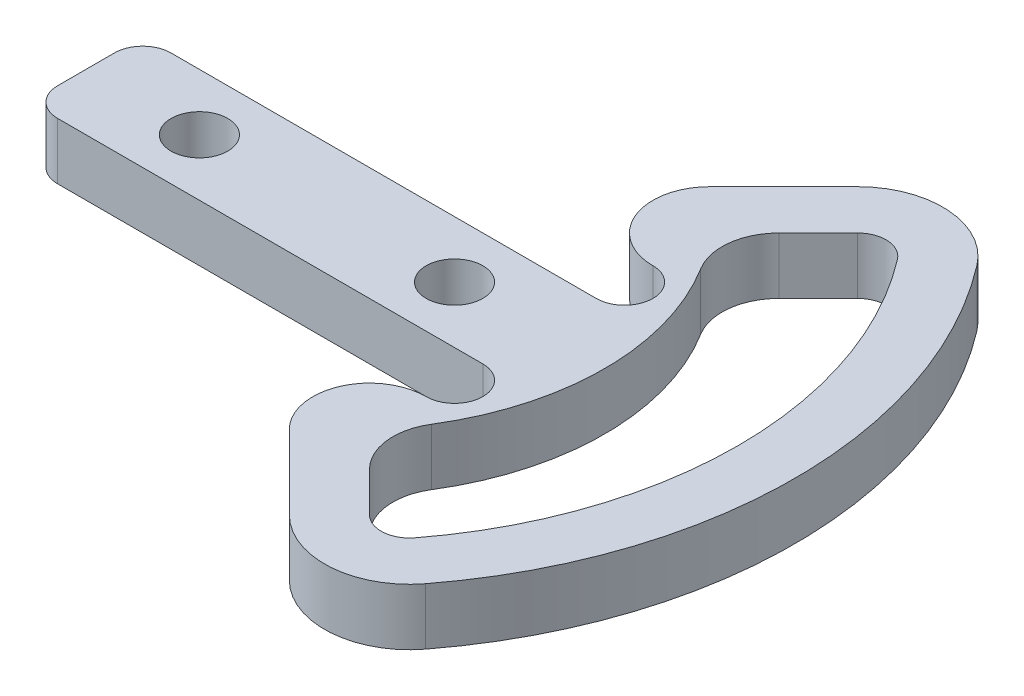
ISO-10303-21;
HEADER;
FILE_DESCRIPTION(('STEP AP214'),'2;1');
FILE_NAME('part.step','',(''),(''),'','','');
FILE_SCHEMA(('AUTOMOTIVE_DESIGN { 1 0 10303 214 1 1 1 1 }'));
ENDSEC;
DATA;
#1=APPLICATION_CONTEXT('core data for automotive mechanical design processes');
#2=APPLICATION_PROTOCOL_DEFINITION('international standard','automotive_design',2000,#1);
#3=PRODUCT_CONTEXT('',#1,'mechanical');
#4=PRODUCT('Part','Part','',(#3));
#5=PRODUCT_RELATED_PRODUCT_CATEGORY('part','',(#4));
#6=PRODUCT_DEFINITION_FORMATION('','',#4);
#7=PRODUCT_DEFINITION_CONTEXT('part definition',#1,'design');
#8=PRODUCT_DEFINITION('design','',#6,#7);
#9=PRODUCT_DEFINITION_SHAPE('','',#8);
#10=(LENGTH_UNIT() NAMED_UNIT(*) SI_UNIT(.MILLI.,.METRE.));
#11=(NAMED_UNIT(*) PLANE_ANGLE_UNIT() SI_UNIT($,.RADIAN.));
#12=(NAMED_UNIT(*) SI_UNIT($,.STERADIAN.) SOLID_ANGLE_UNIT());
#13=UNCERTAINTY_MEASURE_WITH_UNIT(LENGTH_MEASURE(1.E-05),#10,'distance_accuracy_value','');
#14=(GEOMETRIC_REPRESENTATION_CONTEXT(3) GLOBAL_UNCERTAINTY_ASSIGNED_CONTEXT((#13)) GLOBAL_UNIT_ASSIGNED_CONTEXT((#10,
#11,#12)) REPRESENTATION_CONTEXT('',''));
#15=CARTESIAN_POINT('',(0.,0.,0.));
#16=DIRECTION('',(0.,0.,1.));
#17=DIRECTION('',(1.,0.,0.));
#18=AXIS2_PLACEMENT_3D('',#15,#16,#17);
#19=CARTESIAN_POINT('',(5.,5.,-5.));
#20=DIRECTION('',(0.,-1.,0.));
#21=DIRECTION('',(0.,0.,-1.));
#22=AXIS2_PLACEMENT_3D('',#19,#20,#21);
#23=PLANE('',#22);
#24=CARTESIAN_POINT('',(20.,5.,0.));
#25=DIRECTION('',(0.,1.,0.));
#26=DIRECTION('',(0.,0.,1.));
#27=AXIS2_PLACEMENT_3D('',#24,#25,#26);
#28=CIRCLE('',#27,5.);
#29=CARTESIAN_POINT('',(20.,5.,5.));
#30=VERTEX_POINT('',#29);
#31=EDGE_CURVE('E204',#30,#30,#28,.T.);
#32=ORIENTED_EDGE('',*,*,#31,.F.);
#33=EDGE_LOOP('',(#32));
#34=FACE_BOUND('',#33,.T.);
#35=CARTESIAN_POINT('',(5.,5.,-5.));
#36=DIRECTION('',(0.,1.,0.));
#37=DIRECTION('',(0.,0.,-1.));
#38=AXIS2_PLACEMENT_3D('',#35,#36,#37);
#39=CIRCLE('',#38,5.);
#40=CARTESIAN_POINT('',(5.,5.,-10.));
#41=VERTEX_POINT('',#40);
#42=CARTESIAN_POINT('',(0.,5.,-5.));
#43=VERTEX_POINT('',#42);
#44=EDGE_CURVE('E279',#41,#43,#39,.T.);
#45=ORIENTED_EDGE('',*,*,#44,.T.);
#46=DIRECTION('',(0.,0.,1.));
#47=VECTOR('',#46,1.);
#48=CARTESIAN_POINT('',(0.,5.,5.));
#49=LINE('',#48,#47);
#50=CARTESIAN_POINT('',(0.,5.,5.));
#51=VERTEX_POINT('',#50);
#52=EDGE_CURVE('E282',#43,#51,#49,.T.);
#53=ORIENTED_EDGE('',*,*,#52,.T.);
#54=CARTESIAN_POINT('',(5.,5.,5.));
#55=DIRECTION('',(0.,1.,0.));
#56=DIRECTION('',(0.,0.,1.));
#57=AXIS2_PLACEMENT_3D('',#54,#55,#56);
#58=CIRCLE('',#57,5.);
#59=CARTESIAN_POINT('',(5.,5.,10.));
#60=VERTEX_POINT('',#59);
#61=EDGE_CURVE('E284',#51,#60,#58,.T.);
#62=ORIENTED_EDGE('',*,*,#61,.T.);
#63=DIRECTION('',(1.,0.,0.));
#64=VECTOR('',#63,1.);
#65=CARTESIAN_POINT('',(5.,5.,10.));
#66=LINE('',#65,#64);
#67=CARTESIAN_POINT('',(80.,5.,10.));
#68=VERTEX_POINT('',#67);
#69=EDGE_CURVE('E286',#60,#68,#66,.T.);
#70=ORIENTED_EDGE('',*,*,#69,.T.);
#71=CARTESIAN_POINT('',(80.,5.,15.));
#72=DIRECTION('',(0.,-1.,0.));
#73=DIRECTION('',(0.,0.,-1.));
#74=AXIS2_PLACEMENT_3D('',#71,#72,#73);
#75=CIRCLE('',#74,5.);
#76=CARTESIAN_POINT('',(80.,5.,20.));
#77=VERTEX_POINT('',#76);
#78=EDGE_CURVE('E288',#68,#77,#75,.T.);
#79=ORIENTED_EDGE('',*,*,#78,.T.);
#80=CARTESIAN_POINT('',(80.,5.,30.));
#81=DIRECTION('',(0.,1.,0.));
#82=DIRECTION('',(0.,0.,1.));
#83=AXIS2_PLACEMENT_3D('',#80,#81,#82);
#84=CIRCLE('',#83,9.99999999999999);
#85=CARTESIAN_POINT('',(72.9289321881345,5.,37.0710678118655));
#86=VERTEX_POINT('',#85);
#87=EDGE_CURVE('E290',#77,#86,#84,.T.);
#88=ORIENTED_EDGE('',*,*,#87,.T.);
#89=DIRECTION('',(0.707106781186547,0.,0.707106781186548));
#90=VECTOR('',#89,1.);
#91=CARTESIAN_POINT('',(72.9289321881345,5.,37.0710678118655));
#92=LINE('',#91,#90);
#93=CARTESIAN_POINT('',(85.9928689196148,5.,50.1350045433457));
#94=VERTEX_POINT('',#93);
#95=EDGE_CURVE('E292',#86,#94,#92,.T.);
#96=ORIENTED_EDGE('',*,*,#95,.T.);
#97=CARTESIAN_POINT('',(96.599470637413,5.,39.5284028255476));
#98=DIRECTION('',(0.,1.,0.));
#99=DIRECTION('',(0.,0.,1.));
#100=AXIS2_PLACEMENT_3D('',#97,#98,#99);
#101=CIRCLE('',#100,15.);
#102=CARTESIAN_POINT('',(108.507040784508,5.,48.6503419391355));
#103=VERTEX_POINT('',#102);
#104=EDGE_CURVE('E294',#94,#103,#101,.T.);
#105=ORIENTED_EDGE('',*,*,#104,.T.);
#106=CARTESIAN_POINT('',(45.,5.,0.));
#107=DIRECTION('',(0.,1.,0.));
#108=DIRECTION('',(0.,0.,-1.));
#109=AXIS2_PLACEMENT_3D('',#106,#107,#108);
#110=CIRCLE('',#109,80.);
#111=CARTESIAN_POINT('',(108.507040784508,5.,-48.6503419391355));
#112=VERTEX_POINT('',#111);
#113=EDGE_CURVE('E296',#103,#112,#110,.T.);
#114=ORIENTED_EDGE('',*,*,#113,.T.);
#115=CARTESIAN_POINT('',(96.599470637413,5.,-39.5284028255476));
#116=DIRECTION('',(0.,1.,0.));
#117=DIRECTION('',(0.,0.,-1.));
#118=AXIS2_PLACEMENT_3D('',#115,#116,#117);
#119=CIRCLE('',#118,15.);
#120=CARTESIAN_POINT('',(85.9928689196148,5.,-50.1350045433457));
#121=VERTEX_POINT('',#120);
#122=EDGE_CURVE('E298',#112,#121,#119,.T.);
#123=ORIENTED_EDGE('',*,*,#122,.T.);
#124=DIRECTION('',(-0.707106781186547,0.,0.707106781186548));
#125=VECTOR('',#124,1.);
#126=CARTESIAN_POINT('',(72.9289321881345,5.,-37.0710678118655));
#127=LINE('',#126,#125);
#128=CARTESIAN_POINT('',(72.9289321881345,5.,-37.0710678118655));
#129=VERTEX_POINT('',#128);
#130=EDGE_CURVE('E300',#121,#129,#127,.T.);
#131=ORIENTED_EDGE('',*,*,#130,.T.);
#132=CARTESIAN_POINT('',(80.,5.,-30.));
#133=DIRECTION('',(0.,1.,0.));
#134=DIRECTION('',(0.,0.,-1.));
#135=AXIS2_PLACEMENT_3D('',#132,#133,#134);
#136=CIRCLE('',#135,9.99999999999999);
#137=CARTESIAN_POINT('',(80.,5.,-20.));
#138=VERTEX_POINT('',#137);
#139=EDGE_CURVE('E302',#129,#138,#136,.T.);
#140=ORIENTED_EDGE('',*,*,#139,.T.);
#141=CARTESIAN_POINT('',(80.,5.,-15.));
#142=DIRECTION('',(0.,-1.,0.));
#143=DIRECTION('',(0.,0.,1.));
#144=AXIS2_PLACEMENT_3D('',#141,#142,#143);
#145=CIRCLE('',#144,5.);
#146=CARTESIAN_POINT('',(80.,5.,-10.));
#147=VERTEX_POINT('',#146);
#148=EDGE_CURVE('E304',#138,#147,#145,.T.);
#149=ORIENTED_EDGE('',*,*,#148,.T.);
#150=DIRECTION('',(-1.,0.,0.));
#151=VECTOR('',#150,1.);
#152=CARTESIAN_POINT('',(5.,5.,-10.));
#153=LINE('',#152,#151);
#154=EDGE_CURVE('E306',#147,#41,#153,.T.);
#155=ORIENTED_EDGE('',*,*,#154,.T.);
#156=EDGE_LOOP('',(#45,#53,#62,#70,#79,#88,#96,#105,#114,#123,#131,#140,#149,#155));
#157=FACE_BOUND('',#156,.T.);
#158=CARTESIAN_POINT('',(96.599470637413,5.,-39.5284028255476));
#159=DIRECTION('',(0.,1.,0.));
#160=DIRECTION('',(0.,0.,-1.));
#161=AXIS2_PLACEMENT_3D('',#158,#159,#160);
#162=CIRCLE('',#161,5.);
#163=CARTESIAN_POINT('',(100.568660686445,5.,-42.5690491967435));
#164=VERTEX_POINT('',#163);
#165=CARTESIAN_POINT('',(93.0639367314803,5.,-43.0639367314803));
#166=VERTEX_POINT('',#165);
#167=EDGE_CURVE('E196',#164,#166,#162,.T.);
#168=ORIENTED_EDGE('',*,*,#167,.F.);
#169=CARTESIAN_POINT('',(45.,5.,0.));
#170=DIRECTION('',(0.,1.,0.));
#171=DIRECTION('',(0.,0.,-1.));
#172=AXIS2_PLACEMENT_3D('',#169,#170,#171);
#173=CIRCLE('',#172,70.);
#174=CARTESIAN_POINT('',(100.568660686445,5.,42.5690491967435));
#175=VERTEX_POINT('',#174);
#176=EDGE_CURVE('E237',#175,#164,#173,.T.);
#177=ORIENTED_EDGE('',*,*,#176,.F.);
#178=CARTESIAN_POINT('',(96.599470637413,5.,39.5284028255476));
#179=DIRECTION('',(0.,1.,0.));
#180=DIRECTION('',(0.,0.,1.));
#181=AXIS2_PLACEMENT_3D('',#178,#179,#180);
#182=CIRCLE('',#181,4.99999999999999);
#183=CARTESIAN_POINT('',(93.0639367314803,5.,43.0639367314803));
#184=VERTEX_POINT('',#183);
#185=EDGE_CURVE('E235',#184,#175,#182,.T.);
#186=ORIENTED_EDGE('',*,*,#185,.F.);
#187=DIRECTION('',(0.707106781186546,0.,0.707106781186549));
#188=VECTOR('',#187,1.);
#189=CARTESIAN_POINT('',(86.1019934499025,5.,36.1019934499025));
#190=LINE('',#189,#188);
#191=CARTESIAN_POINT('',(86.1019934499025,5.,36.1019934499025));
#192=VERTEX_POINT('',#191);
#193=EDGE_CURVE('E233',#192,#184,#190,.T.);
#194=ORIENTED_EDGE('',*,*,#193,.F.);
#195=CARTESIAN_POINT('',(93.173061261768,5.,29.030925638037));
#196=DIRECTION('',(0.,1.,0.));
#197=DIRECTION('',(0.,0.,-1.));
#198=AXIS2_PLACEMENT_3D('',#195,#196,#197);
#199=CIRCLE('',#198,9.99999999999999);
#200=CARTESIAN_POINT('',(84.6795920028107,5.,23.7525755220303));
#201=VERTEX_POINT('',#200);
#202=EDGE_CURVE('E231',#201,#192,#199,.T.);
#203=ORIENTED_EDGE('',*,*,#202,.F.);
#204=CARTESIAN_POINT('',(46.4589803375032,5.,0.));
#205=DIRECTION('',(0.,-1.,0.));
#206=DIRECTION('',(0.,0.,-1.));
#207=AXIS2_PLACEMENT_3D('',#204,#205,#206);
#208=CIRCLE('',#207,45.);
#209=CARTESIAN_POINT('',(84.6795920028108,5.,-23.7525755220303));
#210=VERTEX_POINT('',#209);
#211=EDGE_CURVE('E229',#210,#201,#208,.T.);
#212=ORIENTED_EDGE('',*,*,#211,.F.);
#213=CARTESIAN_POINT('',(93.173061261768,5.,-29.030925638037));
#214=DIRECTION('',(0.,1.,0.));
#215=DIRECTION('',(0.,0.,-1.));
#216=AXIS2_PLACEMENT_3D('',#213,#214,#215);
#217=CIRCLE('',#216,9.99999999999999);
#218=CARTESIAN_POINT('',(86.1019934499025,5.,-36.1019934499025));
#219=VERTEX_POINT('',#218);
#220=EDGE_CURVE('E227',#219,#210,#217,.T.);
#221=ORIENTED_EDGE('',*,*,#220,.F.);
#222=DIRECTION('',(-0.707106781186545,0.,0.70710678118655));
#223=VECTOR('',#222,1.);
#224=CARTESIAN_POINT('',(86.1019934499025,5.,-36.1019934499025));
#225=LINE('',#224,#223);
#226=EDGE_CURVE('E225',#166,#219,#225,.T.);
#227=ORIENTED_EDGE('',*,*,#226,.F.);
#228=EDGE_LOOP('',(#168,#177,#186,#194,#203,#212,#221,#227));
#229=FACE_BOUND('',#228,.T.);
#230=CARTESIAN_POINT('',(65.,5.,0.));
#231=DIRECTION('',(0.,1.,0.));
#232=DIRECTION('',(0.,0.,1.));
#233=AXIS2_PLACEMENT_3D('',#230,#231,#232);
#234=CIRCLE('',#233,5.);
#235=CARTESIAN_POINT('',(65.,5.,5.));
#236=VERTEX_POINT('',#235);
#237=EDGE_CURVE('E641',#236,#236,#234,.T.);
#238=ORIENTED_EDGE('',*,*,#237,.F.);
#239=EDGE_LOOP('',(#238));
#240=FACE_BOUND('',#239,.T.);
#241=ADVANCED_FACE('F32',(#34,#157,#229,#240),#23,.F.);
#242=CARTESIAN_POINT('',(5.,-5.,-5.));
#243=DIRECTION('',(0.,-1.,0.));
#244=DIRECTION('',(0.,0.,-1.));
#245=AXIS2_PLACEMENT_3D('',#242,#243,#244);
#246=PLANE('',#245);
#247=CARTESIAN_POINT('',(20.,-5.,0.));
#248=DIRECTION('',(0.,1.,0.));
#249=DIRECTION('',(0.,0.,1.));
#250=AXIS2_PLACEMENT_3D('',#247,#248,#249);
#251=CIRCLE('',#250,5.);
#252=CARTESIAN_POINT('',(20.,-5.,5.));
#253=VERTEX_POINT('',#252);
#254=EDGE_CURVE('E207',#253,#253,#251,.T.);
#255=ORIENTED_EDGE('',*,*,#254,.T.);
#256=EDGE_LOOP('',(#255));
#257=FACE_BOUND('',#256,.T.);
#258=CARTESIAN_POINT('',(5.,-5.,-5.));
#259=DIRECTION('',(0.,1.,0.));
#260=DIRECTION('',(0.,0.,-1.));
#261=AXIS2_PLACEMENT_3D('',#258,#259,#260);
#262=CIRCLE('',#261,5.);
#263=CARTESIAN_POINT('',(5.,-5.,-10.));
#264=VERTEX_POINT('',#263);
#265=CARTESIAN_POINT('',(0.,-5.,-5.));
#266=VERTEX_POINT('',#265);
#267=EDGE_CURVE('E197',#264,#266,#262,.T.);
#268=ORIENTED_EDGE('',*,*,#267,.F.);
#269=DIRECTION('',(-1.,0.,0.));
#270=VECTOR('',#269,1.);
#271=CARTESIAN_POINT('',(5.,-5.,-10.));
#272=LINE('',#271,#270);
#273=CARTESIAN_POINT('',(80.,-5.,-10.));
#274=VERTEX_POINT('',#273);
#275=EDGE_CURVE('E277',#274,#264,#272,.T.);
#276=ORIENTED_EDGE('',*,*,#275,.F.);
#277=CARTESIAN_POINT('',(80.,-5.,-15.));
#278=DIRECTION('',(0.,-1.,0.));
#279=DIRECTION('',(0.,0.,1.));
#280=AXIS2_PLACEMENT_3D('',#277,#278,#279);
#281=CIRCLE('',#280,5.);
#282=CARTESIAN_POINT('',(80.,-5.,-20.));
#283=VERTEX_POINT('',#282);
#284=EDGE_CURVE('E275',#283,#274,#281,.T.);
#285=ORIENTED_EDGE('',*,*,#284,.F.);
#286=CARTESIAN_POINT('',(80.,-5.,-30.));
#287=DIRECTION('',(0.,1.,0.));
#288=DIRECTION('',(0.,0.,-1.));
#289=AXIS2_PLACEMENT_3D('',#286,#287,#288);
#290=CIRCLE('',#289,9.99999999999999);
#291=CARTESIAN_POINT('',(72.9289321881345,-5.,-37.0710678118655));
#292=VERTEX_POINT('',#291);
#293=EDGE_CURVE('E273',#292,#283,#290,.T.);
#294=ORIENTED_EDGE('',*,*,#293,.F.);
#295=DIRECTION('',(-0.707106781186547,0.,0.707106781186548));
#296=VECTOR('',#295,1.);
#297=CARTESIAN_POINT('',(72.9289321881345,-5.,-37.0710678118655));
#298=LINE('',#297,#296);
#299=CARTESIAN_POINT('',(85.9928689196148,-5.,-50.1350045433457));
#300=VERTEX_POINT('',#299);
#301=EDGE_CURVE('E271',#300,#292,#298,.T.);
#302=ORIENTED_EDGE('',*,*,#301,.F.);
#303=CARTESIAN_POINT('',(96.599470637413,-5.,-39.5284028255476));
#304=DIRECTION('',(0.,1.,0.));
#305=DIRECTION('',(0.,0.,-1.));
#306=AXIS2_PLACEMENT_3D('',#303,#304,#305);
#307=CIRCLE('',#306,15.);
#308=CARTESIAN_POINT('',(108.507040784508,-5.,-48.6503419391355));
#309=VERTEX_POINT('',#308);
#310=EDGE_CURVE('E269',#309,#300,#307,.T.);
#311=ORIENTED_EDGE('',*,*,#310,.F.);
#312=CARTESIAN_POINT('',(45.,-5.,0.));
#313=DIRECTION('',(0.,1.,0.));
#314=DIRECTION('',(0.,0.,-1.));
#315=AXIS2_PLACEMENT_3D('',#312,#313,#314);
#316=CIRCLE('',#315,80.);
#317=CARTESIAN_POINT('',(108.507040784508,-5.,48.6503419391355));
#318=VERTEX_POINT('',#317);
#319=EDGE_CURVE('E267',#318,#309,#316,.T.);
#320=ORIENTED_EDGE('',*,*,#319,.F.);
#321=CARTESIAN_POINT('',(96.599470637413,-5.,39.5284028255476));
#322=DIRECTION('',(0.,1.,0.));
#323=DIRECTION('',(0.,0.,1.));
#324=AXIS2_PLACEMENT_3D('',#321,#322,#323);
#325=CIRCLE('',#324,15.);
#326=CARTESIAN_POINT('',(85.9928689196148,-5.,50.1350045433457));
#327=VERTEX_POINT('',#326);
#328=EDGE_CURVE('E265',#327,#318,#325,.T.);
#329=ORIENTED_EDGE('',*,*,#328,.F.);
#330=DIRECTION('',(0.707106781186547,0.,0.707106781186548));
#331=VECTOR('',#330,1.);
#332=CARTESIAN_POINT('',(72.9289321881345,-5.,37.0710678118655));
#333=LINE('',#332,#331);
#334=CARTESIAN_POINT('',(72.9289321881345,-5.,37.0710678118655));
#335=VERTEX_POINT('',#334);
#336=EDGE_CURVE('E263',#335,#327,#333,.T.);
#337=ORIENTED_EDGE('',*,*,#336,.F.);
#338=CARTESIAN_POINT('',(80.,-5.,30.));
#339=DIRECTION('',(0.,1.,0.));
#340=DIRECTION('',(0.,0.,1.));
#341=AXIS2_PLACEMENT_3D('',#338,#339,#340);
#342=CIRCLE('',#341,9.99999999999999);
#343=CARTESIAN_POINT('',(80.,-5.,20.));
#344=VERTEX_POINT('',#343);
#345=EDGE_CURVE('E261',#344,#335,#342,.T.);
#346=ORIENTED_EDGE('',*,*,#345,.F.);
#347=CARTESIAN_POINT('',(80.,-5.,15.));
#348=DIRECTION('',(0.,-1.,0.));
#349=DIRECTION('',(0.,0.,-1.));
#350=AXIS2_PLACEMENT_3D('',#347,#348,#349);
#351=CIRCLE('',#350,5.);
#352=CARTESIAN_POINT('',(80.,-5.,10.));
#353=VERTEX_POINT('',#352);
#354=EDGE_CURVE('E259',#353,#344,#351,.T.);
#355=ORIENTED_EDGE('',*,*,#354,.F.);
#356=DIRECTION('',(1.,0.,0.));
#357=VECTOR('',#356,1.);
#358=CARTESIAN_POINT('',(5.,-5.,10.));
#359=LINE('',#358,#357);
#360=CARTESIAN_POINT('',(5.,-5.,10.));
#361=VERTEX_POINT('',#360);
#362=EDGE_CURVE('E257',#361,#353,#359,.T.);
#363=ORIENTED_EDGE('',*,*,#362,.F.);
#364=CARTESIAN_POINT('',(5.,-5.,5.));
#365=DIRECTION('',(0.,1.,0.));
#366=DIRECTION('',(0.,0.,1.));
#367=AXIS2_PLACEMENT_3D('',#364,#365,#366);
#368=CIRCLE('',#367,5.);
#369=CARTESIAN_POINT('',(0.,-5.,5.));
#370=VERTEX_POINT('',#369);
#371=EDGE_CURVE('E255',#370,#361,#368,.T.);
#372=ORIENTED_EDGE('',*,*,#371,.F.);
#373=DIRECTION('',(0.,0.,1.));
#374=VECTOR('',#373,1.);
#375=CARTESIAN_POINT('',(0.,-5.,5.));
#376=LINE('',#375,#374);
#377=EDGE_CURVE('E253',#266,#370,#376,.T.);
#378=ORIENTED_EDGE('',*,*,#377,.F.);
#379=EDGE_LOOP('',(#268,#276,#285,#294,#302,#311,#320,#329,#337,#346,#355,#363,#372,#378));
#380=FACE_BOUND('',#379,.T.);
#381=CARTESIAN_POINT('',(45.,-5.,0.));
#382=DIRECTION('',(0.,1.,0.));
#383=DIRECTION('',(0.,0.,-1.));
#384=AXIS2_PLACEMENT_3D('',#381,#382,#383);
#385=CIRCLE('',#384,70.);
#386=CARTESIAN_POINT('',(100.568660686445,-5.,42.5690491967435));
#387=VERTEX_POINT('',#386);
#388=CARTESIAN_POINT('',(100.568660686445,-5.,-42.5690491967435));
#389=VERTEX_POINT('',#388);
#390=EDGE_CURVE('E203',#387,#389,#385,.T.);
#391=ORIENTED_EDGE('',*,*,#390,.T.);
#392=CARTESIAN_POINT('',(96.599470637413,-5.,-39.5284028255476));
#393=DIRECTION('',(0.,1.,0.));
#394=DIRECTION('',(0.,0.,-1.));
#395=AXIS2_PLACEMENT_3D('',#392,#393,#394);
#396=CIRCLE('',#395,5.);
#397=CARTESIAN_POINT('',(93.0639367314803,-5.,-43.0639367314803));
#398=VERTEX_POINT('',#397);
#399=EDGE_CURVE('E55',#389,#398,#396,.T.);
#400=ORIENTED_EDGE('',*,*,#399,.T.);
#401=DIRECTION('',(-0.707106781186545,0.,0.70710678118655));
#402=VECTOR('',#401,1.);
#403=CARTESIAN_POINT('',(86.1019934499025,-5.,-36.1019934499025));
#404=LINE('',#403,#402);
#405=CARTESIAN_POINT('',(86.1019934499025,-5.,-36.1019934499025));
#406=VERTEX_POINT('',#405);
#407=EDGE_CURVE('E183',#398,#406,#404,.T.);
#408=ORIENTED_EDGE('',*,*,#407,.T.);
#409=CARTESIAN_POINT('',(93.173061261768,-5.,-29.030925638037));
#410=DIRECTION('',(0.,1.,0.));
#411=DIRECTION('',(0.,0.,-1.));
#412=AXIS2_PLACEMENT_3D('',#409,#410,#411);
#413=CIRCLE('',#412,9.99999999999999);
#414=CARTESIAN_POINT('',(84.6795920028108,-5.,-23.7525755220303));
#415=VERTEX_POINT('',#414);
#416=EDGE_CURVE('E192',#406,#415,#413,.T.);
#417=ORIENTED_EDGE('',*,*,#416,.T.);
#418=CARTESIAN_POINT('',(46.4589803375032,-5.,0.));
#419=DIRECTION('',(0.,-1.,0.));
#420=DIRECTION('',(0.,0.,-1.));
#421=AXIS2_PLACEMENT_3D('',#418,#419,#420);
#422=CIRCLE('',#421,45.);
#423=CARTESIAN_POINT('',(84.6795920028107,-5.,23.7525755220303));
#424=VERTEX_POINT('',#423);
#425=EDGE_CURVE('E212',#415,#424,#422,.T.);
#426=ORIENTED_EDGE('',*,*,#425,.T.);
#427=CARTESIAN_POINT('',(93.173061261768,-5.,29.030925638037));
#428=DIRECTION('',(0.,1.,0.));
#429=DIRECTION('',(0.,0.,-1.));
#430=AXIS2_PLACEMENT_3D('',#427,#428,#429);
#431=CIRCLE('',#430,9.99999999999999);
#432=CARTESIAN_POINT('',(86.1019934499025,-5.,36.1019934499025));
#433=VERTEX_POINT('',#432);
#434=EDGE_CURVE('E215',#424,#433,#431,.T.);
#435=ORIENTED_EDGE('',*,*,#434,.T.);
#436=DIRECTION('',(0.707106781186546,0.,0.707106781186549));
#437=VECTOR('',#436,1.);
#438=CARTESIAN_POINT('',(86.1019934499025,-5.,36.1019934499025));
#439=LINE('',#438,#437);
#440=CARTESIAN_POINT('',(93.0639367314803,-5.,43.0639367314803));
#441=VERTEX_POINT('',#440);
#442=EDGE_CURVE('E218',#433,#441,#439,.T.);
#443=ORIENTED_EDGE('',*,*,#442,.T.);
#444=CARTESIAN_POINT('',(96.599470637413,-5.,39.5284028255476));
#445=DIRECTION('',(0.,1.,0.));
#446=DIRECTION('',(0.,0.,1.));
#447=AXIS2_PLACEMENT_3D('',#444,#445,#446);
#448=CIRCLE('',#447,4.99999999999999);
#449=EDGE_CURVE('E221',#441,#387,#448,.T.);
#450=ORIENTED_EDGE('',*,*,#449,.T.);
#451=EDGE_LOOP('',(#391,#400,#408,#417,#426,#435,#443,#450));
#452=FACE_BOUND('',#451,.T.);
#453=CARTESIAN_POINT('',(65.,-5.,0.));
#454=DIRECTION('',(0.,1.,0.));
#455=DIRECTION('',(0.,0.,1.));
#456=AXIS2_PLACEMENT_3D('',#453,#454,#455);
#457=CIRCLE('',#456,5.);
#458=CARTESIAN_POINT('',(65.,-5.,5.));
#459=VERTEX_POINT('',#458);
#460=EDGE_CURVE('E644',#459,#459,#457,.T.);
#461=ORIENTED_EDGE('',*,*,#460,.T.);
#462=EDGE_LOOP('',(#461));
#463=FACE_BOUND('',#462,.T.);
#464=ADVANCED_FACE('F200',(#257,#380,#452,#463),#246,.T.);
#465=CARTESIAN_POINT('',(5.,5.,-5.));
#466=DIRECTION('',(0.,-1.,0.));
#467=DIRECTION('',(0.,0.,-1.));
#468=AXIS2_PLACEMENT_3D('',#465,#466,#467);
#469=CYLINDRICAL_SURFACE('',#468,5.);
#470=ORIENTED_EDGE('',*,*,#267,.T.);
#471=DIRECTION('',(0.,-1.,0.));
#472=VECTOR('',#471,1.);
#473=CARTESIAN_POINT('',(0.,5.,-5.));
#474=LINE('',#473,#472);
#475=EDGE_CURVE('E11',#43,#266,#474,.T.);
#476=ORIENTED_EDGE('',*,*,#475,.F.);
#477=ORIENTED_EDGE('',*,*,#44,.F.);
#478=DIRECTION('',(0.,-1.,0.));
#479=VECTOR('',#478,1.);
#480=CARTESIAN_POINT('',(5.,5.,-10.));
#481=LINE('',#480,#479);
#482=EDGE_CURVE('E308',#41,#264,#481,.T.);
#483=ORIENTED_EDGE('',*,*,#482,.T.);
#484=EDGE_LOOP('',(#470,#476,#477,#483));
#485=FACE_BOUND('',#484,.T.);
#486=ADVANCED_FACE('F34',(#485),#469,.T.);
#487=CARTESIAN_POINT('',(0.,5.,5.));
#488=DIRECTION('',(1.,0.,0.));
#489=DIRECTION('',(0.,0.,-1.));
#490=AXIS2_PLACEMENT_3D('',#487,#488,#489);
#491=PLANE('',#490);
#492=ORIENTED_EDGE('',*,*,#377,.T.);
#493=DIRECTION('',(0.,-1.,0.));
#494=VECTOR('',#493,1.);
#495=CARTESIAN_POINT('',(0.,5.,5.));
#496=LINE('',#495,#494);
#497=EDGE_CURVE('E40',#51,#370,#496,.T.);
#498=ORIENTED_EDGE('',*,*,#497,.F.);
#499=ORIENTED_EDGE('',*,*,#52,.F.);
#500=ORIENTED_EDGE('',*,*,#475,.T.);
#501=EDGE_LOOP('',(#492,#498,#499,#500));
#502=FACE_BOUND('',#501,.T.);
#503=ADVANCED_FACE('F370',(#502),#491,.F.);
#504=CARTESIAN_POINT('',(5.,5.,5.));
#505=DIRECTION('',(0.,-1.,0.));
#506=DIRECTION('',(0.,0.,-1.));
#507=AXIS2_PLACEMENT_3D('',#504,#505,#506);
#508=CYLINDRICAL_SURFACE('',#507,5.);
#509=ORIENTED_EDGE('',*,*,#371,.T.);
#510=DIRECTION('',(0.,-1.,0.));
#511=VECTOR('',#510,1.);
#512=CARTESIAN_POINT('',(5.,5.,10.));
#513=LINE('',#512,#511);
#514=EDGE_CURVE('E341',#60,#361,#513,.T.);
#515=ORIENTED_EDGE('',*,*,#514,.F.);
#516=ORIENTED_EDGE('',*,*,#61,.F.);
#517=ORIENTED_EDGE('',*,*,#497,.T.);
#518=EDGE_LOOP('',(#509,#515,#516,#517));
#519=FACE_BOUND('',#518,.T.);
#520=ADVANCED_FACE('F348',(#519),#508,.T.);
#521=CARTESIAN_POINT('',(5.,5.,10.));
#522=DIRECTION('',(0.,0.,-1.));
#523=DIRECTION('',(-1.,0.,0.));
#524=AXIS2_PLACEMENT_3D('',#521,#522,#523);
#525=PLANE('',#524);
#526=ORIENTED_EDGE('',*,*,#362,.T.);
#527=DIRECTION('',(0.,-1.,0.));
#528=VECTOR('',#527,1.);
#529=CARTESIAN_POINT('',(80.,5.,10.));
#530=LINE('',#529,#528);
#531=EDGE_CURVE('E338',#68,#353,#530,.T.);
#532=ORIENTED_EDGE('',*,*,#531,.F.);
#533=ORIENTED_EDGE('',*,*,#69,.F.);
#534=ORIENTED_EDGE('',*,*,#514,.T.);
#535=EDGE_LOOP('',(#526,#532,#533,#534));
#536=FACE_BOUND('',#535,.T.);
#537=ADVANCED_FACE('F358',(#536),#525,.F.);
#538=CARTESIAN_POINT('',(80.,5.,15.));
#539=DIRECTION('',(0.,-1.,0.));
#540=DIRECTION('',(0.,0.,-1.));
#541=AXIS2_PLACEMENT_3D('',#538,#539,#540);
#542=CYLINDRICAL_SURFACE('',#541,5.);
#543=ORIENTED_EDGE('',*,*,#354,.T.);
#544=DIRECTION('',(0.,-1.,0.));
#545=VECTOR('',#544,1.);
#546=CARTESIAN_POINT('',(80.,5.,20.));
#547=LINE('',#546,#545);
#548=EDGE_CURVE('E335',#77,#344,#547,.T.);
#549=ORIENTED_EDGE('',*,*,#548,.F.);
#550=ORIENTED_EDGE('',*,*,#78,.F.);
#551=ORIENTED_EDGE('',*,*,#531,.T.);
#552=EDGE_LOOP('',(#543,#549,#550,#551));
#553=FACE_BOUND('',#552,.T.);
#554=ADVANCED_FACE('F362',(#553),#542,.F.);
#555=CARTESIAN_POINT('',(80.,5.,30.));
#556=DIRECTION('',(0.,-1.,0.));
#557=DIRECTION('',(0.,0.,-1.));
#558=AXIS2_PLACEMENT_3D('',#555,#556,#557);
#559=CYLINDRICAL_SURFACE('',#558,9.99999999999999);
#560=ORIENTED_EDGE('',*,*,#345,.T.);
#561=DIRECTION('',(0.,-1.,0.));
#562=VECTOR('',#561,1.);
#563=CARTESIAN_POINT('',(72.9289321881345,5.,37.0710678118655));
#564=LINE('',#563,#562);
#565=EDGE_CURVE('E332',#86,#335,#564,.T.);
#566=ORIENTED_EDGE('',*,*,#565,.F.);
#567=ORIENTED_EDGE('',*,*,#87,.F.);
#568=ORIENTED_EDGE('',*,*,#548,.T.);
#569=EDGE_LOOP('',(#560,#566,#567,#568));
#570=FACE_BOUND('',#569,.T.);
#571=ADVANCED_FACE('F413',(#570),#559,.T.);
#572=CARTESIAN_POINT('',(72.9289321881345,5.,37.0710678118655));
#573=DIRECTION('',(0.707106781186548,0.,-0.707106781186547));
#574=DIRECTION('',(-0.707106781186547,0.,-0.707106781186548));
#575=AXIS2_PLACEMENT_3D('',#572,#573,#574);
#576=PLANE('',#575);
#577=ORIENTED_EDGE('',*,*,#336,.T.);
#578=DIRECTION('',(0.,-1.,0.));
#579=VECTOR('',#578,1.);
#580=CARTESIAN_POINT('',(85.9928689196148,5.,50.1350045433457));
#581=LINE('',#580,#579);
#582=EDGE_CURVE('E329',#94,#327,#581,.T.);
#583=ORIENTED_EDGE('',*,*,#582,.F.);
#584=ORIENTED_EDGE('',*,*,#95,.F.);
#585=ORIENTED_EDGE('',*,*,#565,.T.);
#586=EDGE_LOOP('',(#577,#583,#584,#585));
#587=FACE_BOUND('',#586,.T.);
#588=ADVANCED_FACE('F411',(#587),#576,.F.);
#589=CARTESIAN_POINT('',(96.599470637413,5.,39.5284028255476));
#590=DIRECTION('',(0.,-1.,0.));
#591=DIRECTION('',(0.,0.,-1.));
#592=AXIS2_PLACEMENT_3D('',#589,#590,#591);
#593=CYLINDRICAL_SURFACE('',#592,15.);
#594=ORIENTED_EDGE('',*,*,#328,.T.);
#595=DIRECTION('',(0.,-1.,0.));
#596=VECTOR('',#595,1.);
#597=CARTESIAN_POINT('',(108.507040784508,5.,48.6503419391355));
#598=LINE('',#597,#596);
#599=EDGE_CURVE('E326',#103,#318,#598,.T.);
#600=ORIENTED_EDGE('',*,*,#599,.F.);
#601=ORIENTED_EDGE('',*,*,#104,.F.);
#602=ORIENTED_EDGE('',*,*,#582,.T.);
#603=EDGE_LOOP('',(#594,#600,#601,#602));
#604=FACE_BOUND('',#603,.T.);
#605=ADVANCED_FACE('F406',(#604),#593,.T.);
#606=CARTESIAN_POINT('',(45.,5.,0.));
#607=DIRECTION('',(0.,-1.,0.));
#608=DIRECTION('',(0.,0.,-1.));
#609=AXIS2_PLACEMENT_3D('',#606,#607,#608);
#610=CYLINDRICAL_SURFACE('',#609,80.);
#611=ORIENTED_EDGE('',*,*,#319,.T.);
#612=DIRECTION('',(0.,-1.,0.));
#613=VECTOR('',#612,1.);
#614=CARTESIAN_POINT('',(108.507040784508,5.,-48.6503419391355));
#615=LINE('',#614,#613);
#616=EDGE_CURVE('E323',#112,#309,#615,.T.);
#617=ORIENTED_EDGE('',*,*,#616,.F.);
#618=ORIENTED_EDGE('',*,*,#113,.F.);
#619=ORIENTED_EDGE('',*,*,#599,.T.);
#620=EDGE_LOOP('',(#611,#617,#618,#619));
#621=FACE_BOUND('',#620,.T.);
#622=ADVANCED_FACE('F401',(#621),#610,.T.);
#623=CARTESIAN_POINT('',(96.599470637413,5.,-39.5284028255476));
#624=DIRECTION('',(0.,-1.,0.));
#625=DIRECTION('',(0.,0.,-1.));
#626=AXIS2_PLACEMENT_3D('',#623,#624,#625);
#627=CYLINDRICAL_SURFACE('',#626,15.);
#628=ORIENTED_EDGE('',*,*,#310,.T.);
#629=DIRECTION('',(0.,-1.,0.));
#630=VECTOR('',#629,1.);
#631=CARTESIAN_POINT('',(85.9928689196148,5.,-50.1350045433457));
#632=LINE('',#631,#630);
#633=EDGE_CURVE('E320',#121,#300,#632,.T.);
#634=ORIENTED_EDGE('',*,*,#633,.F.);
#635=ORIENTED_EDGE('',*,*,#122,.F.);
#636=ORIENTED_EDGE('',*,*,#616,.T.);
#637=EDGE_LOOP('',(#628,#634,#635,#636));
#638=FACE_BOUND('',#637,.T.);
#639=ADVANCED_FACE('F397',(#638),#627,.T.);
#640=CARTESIAN_POINT('',(72.9289321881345,5.,-37.0710678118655));
#641=DIRECTION('',(0.707106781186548,0.,0.707106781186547));
#642=DIRECTION('',(0.707106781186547,0.,-0.707106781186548));
#643=AXIS2_PLACEMENT_3D('',#640,#641,#642);
#644=PLANE('',#643);
#645=ORIENTED_EDGE('',*,*,#301,.T.);
#646=DIRECTION('',(0.,-1.,0.));
#647=VECTOR('',#646,1.);
#648=CARTESIAN_POINT('',(72.9289321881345,5.,-37.0710678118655));
#649=LINE('',#648,#647);
#650=EDGE_CURVE('E317',#129,#292,#649,.T.);
#651=ORIENTED_EDGE('',*,*,#650,.F.);
#652=ORIENTED_EDGE('',*,*,#130,.F.);
#653=ORIENTED_EDGE('',*,*,#633,.T.);
#654=EDGE_LOOP('',(#645,#651,#652,#653));
#655=FACE_BOUND('',#654,.T.);
#656=ADVANCED_FACE('F392',(#655),#644,.F.);
#657=CARTESIAN_POINT('',(80.,5.,-30.));
#658=DIRECTION('',(0.,-1.,0.));
#659=DIRECTION('',(0.,0.,-1.));
#660=AXIS2_PLACEMENT_3D('',#657,#658,#659);
#661=CYLINDRICAL_SURFACE('',#660,9.99999999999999);
#662=ORIENTED_EDGE('',*,*,#293,.T.);
#663=DIRECTION('',(0.,-1.,0.));
#664=VECTOR('',#663,1.);
#665=CARTESIAN_POINT('',(80.,5.,-20.));
#666=LINE('',#665,#664);
#667=EDGE_CURVE('E314',#138,#283,#666,.T.);
#668=ORIENTED_EDGE('',*,*,#667,.F.);
#669=ORIENTED_EDGE('',*,*,#139,.F.);
#670=ORIENTED_EDGE('',*,*,#650,.T.);
#671=EDGE_LOOP('',(#662,#668,#669,#670));
#672=FACE_BOUND('',#671,.T.);
#673=ADVANCED_FACE('F386',(#672),#661,.T.);
#674=CARTESIAN_POINT('',(80.,5.,-15.));
#675=DIRECTION('',(0.,-1.,0.));
#676=DIRECTION('',(0.,0.,-1.));
#677=AXIS2_PLACEMENT_3D('',#674,#675,#676);
#678=CYLINDRICAL_SURFACE('',#677,5.);
#679=ORIENTED_EDGE('',*,*,#284,.T.);
#680=DIRECTION('',(0.,-1.,0.));
#681=VECTOR('',#680,1.);
#682=CARTESIAN_POINT('',(80.,5.,-10.));
#683=LINE('',#682,#681);
#684=EDGE_CURVE('E311',#147,#274,#683,.T.);
#685=ORIENTED_EDGE('',*,*,#684,.F.);
#686=ORIENTED_EDGE('',*,*,#148,.F.);
#687=ORIENTED_EDGE('',*,*,#667,.T.);
#688=EDGE_LOOP('',(#679,#685,#686,#687));
#689=FACE_BOUND('',#688,.T.);
#690=ADVANCED_FACE('F382',(#689),#678,.F.);
#691=CARTESIAN_POINT('',(5.,5.,-10.));
#692=DIRECTION('',(0.,0.,1.));
#693=DIRECTION('',(1.,0.,0.));
#694=AXIS2_PLACEMENT_3D('',#691,#692,#693);
#695=PLANE('',#694);
#696=ORIENTED_EDGE('',*,*,#275,.T.);
#697=ORIENTED_EDGE('',*,*,#482,.F.);
#698=ORIENTED_EDGE('',*,*,#154,.F.);
#699=ORIENTED_EDGE('',*,*,#684,.T.);
#700=EDGE_LOOP('',(#696,#697,#698,#699));
#701=FACE_BOUND('',#700,.T.);
#702=ADVANCED_FACE('F377',(#701),#695,.F.);
#703=CARTESIAN_POINT('',(96.599470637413,5.,-39.5284028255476));
#704=DIRECTION('',(0.,-1.,0.));
#705=DIRECTION('',(0.,0.,-1.));
#706=AXIS2_PLACEMENT_3D('',#703,#704,#705);
#707=CYLINDRICAL_SURFACE('',#706,5.);
#708=ORIENTED_EDGE('',*,*,#399,.F.);
#709=DIRECTION('',(0.,-1.,0.));
#710=VECTOR('',#709,1.);
#711=CARTESIAN_POINT('',(100.568660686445,5.,-42.5690491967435));
#712=LINE('',#711,#710);
#713=EDGE_CURVE('E239',#164,#389,#712,.T.);
#714=ORIENTED_EDGE('',*,*,#713,.F.);
#715=ORIENTED_EDGE('',*,*,#167,.T.);
#716=DIRECTION('',(0.,-1.,0.));
#717=VECTOR('',#716,1.);
#718=CARTESIAN_POINT('',(93.0639367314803,5.,-43.0639367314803));
#719=LINE('',#718,#717);
#720=EDGE_CURVE('E185',#166,#398,#719,.T.);
#721=ORIENTED_EDGE('',*,*,#720,.T.);
#722=EDGE_LOOP('',(#708,#714,#715,#721));
#723=FACE_BOUND('',#722,.T.);
#724=ADVANCED_FACE('F194',(#723),#707,.F.);
#725=CARTESIAN_POINT('',(86.1019934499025,5.,-36.1019934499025));
#726=DIRECTION('',(0.70710678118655,0.,0.707106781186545));
#727=DIRECTION('',(0.707106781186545,0.,-0.70710678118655));
#728=AXIS2_PLACEMENT_3D('',#725,#726,#727);
#729=PLANE('',#728);
#730=ORIENTED_EDGE('',*,*,#407,.F.);
#731=ORIENTED_EDGE('',*,*,#720,.F.);
#732=ORIENTED_EDGE('',*,*,#226,.T.);
#733=DIRECTION('',(0.,-1.,0.));
#734=VECTOR('',#733,1.);
#735=CARTESIAN_POINT('',(86.1019934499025,5.,-36.1019934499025));
#736=LINE('',#735,#734);
#737=EDGE_CURVE('E188',#219,#406,#736,.T.);
#738=ORIENTED_EDGE('',*,*,#737,.T.);
#739=EDGE_LOOP('',(#730,#731,#732,#738));
#740=FACE_BOUND('',#739,.T.);
#741=ADVANCED_FACE('F184',(#740),#729,.T.);
#742=CARTESIAN_POINT('',(93.173061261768,5.,-29.030925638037));
#743=DIRECTION('',(0.,-1.,0.));
#744=DIRECTION('',(0.,0.,-1.));
#745=AXIS2_PLACEMENT_3D('',#742,#743,#744);
#746=CYLINDRICAL_SURFACE('',#745,9.99999999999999);
#747=ORIENTED_EDGE('',*,*,#416,.F.);
#748=ORIENTED_EDGE('',*,*,#737,.F.);
#749=ORIENTED_EDGE('',*,*,#220,.T.);
#750=DIRECTION('',(0.,-1.,0.));
#751=VECTOR('',#750,1.);
#752=CARTESIAN_POINT('',(84.6795920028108,5.,-23.7525755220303));
#753=LINE('',#752,#751);
#754=EDGE_CURVE('E248',#210,#415,#753,.T.);
#755=ORIENTED_EDGE('',*,*,#754,.T.);
#756=EDGE_LOOP('',(#747,#748,#749,#755));
#757=FACE_BOUND('',#756,.T.);
#758=ADVANCED_FACE('F485',(#757),#746,.F.);
#759=CARTESIAN_POINT('',(46.4589803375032,5.,0.));
#760=DIRECTION('',(0.,-1.,0.));
#761=DIRECTION('',(0.,0.,-1.));
#762=AXIS2_PLACEMENT_3D('',#759,#760,#761);
#763=CYLINDRICAL_SURFACE('',#762,45.);
#764=ORIENTED_EDGE('',*,*,#425,.F.);
#765=ORIENTED_EDGE('',*,*,#754,.F.);
#766=ORIENTED_EDGE('',*,*,#211,.T.);
#767=DIRECTION('',(0.,-1.,0.));
#768=VECTOR('',#767,1.);
#769=CARTESIAN_POINT('',(84.6795920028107,5.,23.7525755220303));
#770=LINE('',#769,#768);
#771=EDGE_CURVE('E246',#201,#424,#770,.T.);
#772=ORIENTED_EDGE('',*,*,#771,.T.);
#773=EDGE_LOOP('',(#764,#765,#766,#772));
#774=FACE_BOUND('',#773,.T.);
#775=ADVANCED_FACE('F492',(#774),#763,.T.);
#776=CARTESIAN_POINT('',(93.173061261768,5.,29.030925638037));
#777=DIRECTION('',(0.,-1.,0.));
#778=DIRECTION('',(0.,0.,-1.));
#779=AXIS2_PLACEMENT_3D('',#776,#777,#778);
#780=CYLINDRICAL_SURFACE('',#779,9.99999999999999);
#781=ORIENTED_EDGE('',*,*,#434,.F.);
#782=ORIENTED_EDGE('',*,*,#771,.F.);
#783=ORIENTED_EDGE('',*,*,#202,.T.);
#784=DIRECTION('',(0.,-1.,0.));
#785=VECTOR('',#784,1.);
#786=CARTESIAN_POINT('',(86.1019934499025,5.,36.1019934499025));
#787=LINE('',#786,#785);
#788=EDGE_CURVE('E244',#192,#433,#787,.T.);
#789=ORIENTED_EDGE('',*,*,#788,.T.);
#790=EDGE_LOOP('',(#781,#782,#783,#789));
#791=FACE_BOUND('',#790,.T.);
#792=ADVANCED_FACE('F500',(#791),#780,.F.);
#793=CARTESIAN_POINT('',(86.1019934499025,5.,36.1019934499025));
#794=DIRECTION('',(0.707106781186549,0.,-0.707106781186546));
#795=DIRECTION('',(-0.707106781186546,0.,-0.707106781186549));
#796=AXIS2_PLACEMENT_3D('',#793,#794,#795);
#797=PLANE('',#796);
#798=ORIENTED_EDGE('',*,*,#442,.F.);
#799=ORIENTED_EDGE('',*,*,#788,.F.);
#800=ORIENTED_EDGE('',*,*,#193,.T.);
#801=DIRECTION('',(0.,-1.,0.));
#802=VECTOR('',#801,1.);
#803=CARTESIAN_POINT('',(93.0639367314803,5.,43.0639367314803));
#804=LINE('',#803,#802);
#805=EDGE_CURVE('E242',#184,#441,#804,.T.);
#806=ORIENTED_EDGE('',*,*,#805,.T.);
#807=EDGE_LOOP('',(#798,#799,#800,#806));
#808=FACE_BOUND('',#807,.T.);
#809=ADVANCED_FACE('F508',(#808),#797,.T.);
#810=CARTESIAN_POINT('',(96.599470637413,5.,39.5284028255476));
#811=DIRECTION('',(0.,-1.,0.));
#812=DIRECTION('',(0.,0.,-1.));
#813=AXIS2_PLACEMENT_3D('',#810,#811,#812);
#814=CYLINDRICAL_SURFACE('',#813,4.99999999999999);
#815=ORIENTED_EDGE('',*,*,#449,.F.);
#816=ORIENTED_EDGE('',*,*,#805,.F.);
#817=ORIENTED_EDGE('',*,*,#185,.T.);
#818=DIRECTION('',(0.,-1.,0.));
#819=VECTOR('',#818,1.);
#820=CARTESIAN_POINT('',(100.568660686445,5.,42.5690491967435));
#821=LINE('',#820,#819);
#822=EDGE_CURVE('E47',#175,#387,#821,.T.);
#823=ORIENTED_EDGE('',*,*,#822,.T.);
#824=EDGE_LOOP('',(#815,#816,#817,#823));
#825=FACE_BOUND('',#824,.T.);
#826=ADVANCED_FACE('F516',(#825),#814,.F.);
#827=CARTESIAN_POINT('',(45.,5.,0.));
#828=DIRECTION('',(0.,-1.,0.));
#829=DIRECTION('',(0.,0.,-1.));
#830=AXIS2_PLACEMENT_3D('',#827,#828,#829);
#831=CYLINDRICAL_SURFACE('',#830,70.);
#832=ORIENTED_EDGE('',*,*,#390,.F.);
#833=ORIENTED_EDGE('',*,*,#822,.F.);
#834=ORIENTED_EDGE('',*,*,#176,.T.);
#835=ORIENTED_EDGE('',*,*,#713,.T.);
#836=EDGE_LOOP('',(#832,#833,#834,#835));
#837=FACE_BOUND('',#836,.T.);
#838=ADVANCED_FACE('F524',(#837),#831,.F.);
#839=CARTESIAN_POINT('',(20.,5.,0.));
#840=DIRECTION('',(0.,-1.,0.));
#841=DIRECTION('',(0.,0.,-1.));
#842=AXIS2_PLACEMENT_3D('',#839,#840,#841);
#843=CYLINDRICAL_SURFACE('',#842,5.);
#844=ORIENTED_EDGE('',*,*,#31,.T.);
#845=EDGE_LOOP('',(#844));
#846=FACE_BOUND('',#845,.T.);
#847=ORIENTED_EDGE('',*,*,#254,.F.);
#848=EDGE_LOOP('',(#847));
#849=FACE_BOUND('',#848,.T.);
#850=ADVANCED_FACE('F532',(#846,#849),#843,.F.);
#851=CARTESIAN_POINT('',(65.,5.,0.));
#852=DIRECTION('',(0.,-1.,0.));
#853=DIRECTION('',(0.,0.,-1.));
#854=AXIS2_PLACEMENT_3D('',#851,#852,#853);
#855=CYLINDRICAL_SURFACE('',#854,5.);
#856=ORIENTED_EDGE('',*,*,#237,.T.);
#857=EDGE_LOOP('',(#856));
#858=FACE_BOUND('',#857,.T.);
#859=ORIENTED_EDGE('',*,*,#460,.F.);
#860=EDGE_LOOP('',(#859));
#861=FACE_BOUND('',#860,.T.);
#862=ADVANCED_FACE('F539',(#858,#861),#855,.F.);
#863=CLOSED_SHELL('',(#241,#464,#486,#503,#520,#537,#554,#571,#588,#605,#622,#639,#656,#673,
#690,#702,#724,#741,#758,#775,#792,#809,#826,#838,#850,#862));
#864=MANIFOLD_SOLID_BREP('B2',#863);
#865=ADVANCED_BREP_SHAPE_REPRESENTATION('',(#18,#864),#14);
#866=SHAPE_DEFINITION_REPRESENTATION(#9,#865);
ENDSEC;
END-ISO-10303-21;
